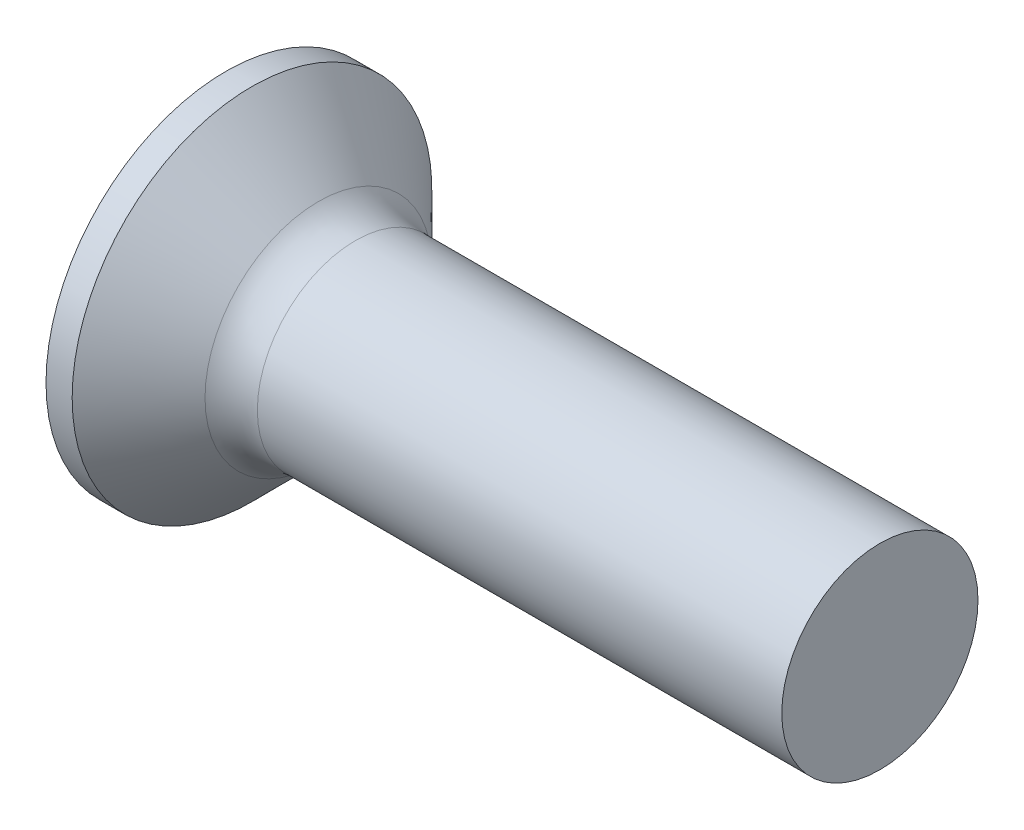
ISO-10303-21;
HEADER;
FILE_DESCRIPTION(('STEP AP214'),'2;1');
FILE_NAME('part.step','',(''),(''),'','','');
FILE_SCHEMA(('AUTOMOTIVE_DESIGN { 1 0 10303 214 1 1 1 1 }'));
ENDSEC;
DATA;
#1=APPLICATION_CONTEXT('core data for automotive mechanical design processes');
#2=APPLICATION_PROTOCOL_DEFINITION('international standard','automotive_design',2000,#1);
#3=PRODUCT_CONTEXT('',#1,'mechanical');
#4=PRODUCT('Part','Part','',(#3));
#5=PRODUCT_RELATED_PRODUCT_CATEGORY('part','',(#4));
#6=PRODUCT_DEFINITION_FORMATION('','',#4);
#7=PRODUCT_DEFINITION_CONTEXT('part definition',#1,'design');
#8=PRODUCT_DEFINITION('design','',#6,#7);
#9=PRODUCT_DEFINITION_SHAPE('','',#8);
#10=(LENGTH_UNIT() NAMED_UNIT(*) SI_UNIT(.MILLI.,.METRE.));
#11=(NAMED_UNIT(*) PLANE_ANGLE_UNIT() SI_UNIT($,.RADIAN.));
#12=(NAMED_UNIT(*) SI_UNIT($,.STERADIAN.) SOLID_ANGLE_UNIT());
#13=UNCERTAINTY_MEASURE_WITH_UNIT(LENGTH_MEASURE(1.E-05),#10,'distance_accuracy_value','');
#14=(GEOMETRIC_REPRESENTATION_CONTEXT(3) GLOBAL_UNCERTAINTY_ASSIGNED_CONTEXT((#13)) GLOBAL_UNIT_ASSIGNED_CONTEXT((#10,
#11,#12)) REPRESENTATION_CONTEXT('',''));
#15=CARTESIAN_POINT('',(0.,0.,0.));
#16=DIRECTION('',(0.,0.,1.));
#17=DIRECTION('',(1.,0.,0.));
#18=AXIS2_PLACEMENT_3D('',#15,#16,#17);
#19=CARTESIAN_POINT('',(0.,0.,0.));
#20=DIRECTION('',(-1.,0.,0.));
#21=DIRECTION('',(0.,0.,1.));
#22=AXIS2_PLACEMENT_3D('',#19,#20,#21);
#23=PLANE('',#22);
#24=CARTESIAN_POINT('',(0.,0.,0.));
#25=DIRECTION('',(-1.,0.,0.));
#26=DIRECTION('',(0.,0.,1.));
#27=AXIS2_PLACEMENT_3D('',#24,#25,#26);
#28=CIRCLE('',#27,2.75);
#29=CARTESIAN_POINT('',(0.,0.,2.75));
#30=VERTEX_POINT('',#29);
#31=EDGE_CURVE('E338',#30,#30,#28,.T.);
#32=ORIENTED_EDGE('',*,*,#31,.T.);
#33=EDGE_LOOP('',(#32));
#34=FACE_BOUND('',#33,.T.);
#35=DIRECTION('',(0.,0.,-1.));
#36=VECTOR('',#35,1.);
#37=CARTESIAN_POINT('',(0.,-0.370000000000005,1.5));
#38=LINE('',#37,#36);
#39=CARTESIAN_POINT('',(0.,-0.370000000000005,1.5));
#40=VERTEX_POINT('',#39);
#41=CARTESIAN_POINT('',(0.,-0.370000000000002,0.590157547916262));
#42=VERTEX_POINT('',#41);
#43=EDGE_CURVE('E377',#40,#42,#38,.T.);
#44=ORIENTED_EDGE('',*,*,#43,.T.);
#45=CARTESIAN_POINT('',(0.,0.,0.));
#46=DIRECTION('',(-1.,0.,0.));
#47=DIRECTION('',(0.,0.,1.));
#48=AXIS2_PLACEMENT_3D('',#45,#46,#47);
#49=CIRCLE('',#48,0.696552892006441);
#50=CARTESIAN_POINT('',(0.,-0.590157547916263,0.37));
#51=VERTEX_POINT('',#50);
#52=EDGE_CURVE('E364',#51,#42,#49,.T.);
#53=ORIENTED_EDGE('',*,*,#52,.F.);
#54=DIRECTION('',(0.,-1.,0.));
#55=VECTOR('',#54,1.);
#56=CARTESIAN_POINT('',(0.,1.5,0.37));
#57=LINE('',#56,#55);
#58=CARTESIAN_POINT('',(0.,-1.5,0.37));
#59=VERTEX_POINT('',#58);
#60=EDGE_CURVE('E424',#51,#59,#57,.T.);
#61=ORIENTED_EDGE('',*,*,#60,.T.);
#62=DIRECTION('',(0.,0.,-1.));
#63=VECTOR('',#62,1.);
#64=CARTESIAN_POINT('',(0.,-1.5,0.37));
#65=LINE('',#64,#63);
#66=CARTESIAN_POINT('',(0.,-1.5,-0.37));
#67=VERTEX_POINT('',#66);
#68=EDGE_CURVE('E335',#59,#67,#65,.T.);
#69=ORIENTED_EDGE('',*,*,#68,.T.);
#70=DIRECTION('',(0.,1.,0.));
#71=VECTOR('',#70,1.);
#72=CARTESIAN_POINT('',(0.,-1.5,-0.37));
#73=LINE('',#72,#71);
#74=CARTESIAN_POINT('',(0.,-0.590157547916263,-0.37));
#75=VERTEX_POINT('',#74);
#76=EDGE_CURVE('E425',#67,#75,#73,.T.);
#77=ORIENTED_EDGE('',*,*,#76,.T.);
#78=CARTESIAN_POINT('',(0.,-0.369999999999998,-0.590157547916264));
#79=VERTEX_POINT('',#78);
#80=EDGE_CURVE('E370',#79,#75,#49,.T.);
#81=ORIENTED_EDGE('',*,*,#80,.F.);
#82=CARTESIAN_POINT('',(0.,-0.369999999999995,-1.5));
#83=VERTEX_POINT('',#82);
#84=EDGE_CURVE('E386',#79,#83,#38,.T.);
#85=ORIENTED_EDGE('',*,*,#84,.T.);
#86=DIRECTION('',(0.,1.,0.));
#87=VECTOR('',#86,1.);
#88=CARTESIAN_POINT('',(0.,-0.369999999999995,-1.5));
#89=LINE('',#88,#87);
#90=CARTESIAN_POINT('',(0.,0.370000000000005,-1.5));
#91=VERTEX_POINT('',#90);
#92=EDGE_CURVE('E385',#83,#91,#89,.T.);
#93=ORIENTED_EDGE('',*,*,#92,.T.);
#94=DIRECTION('',(0.,0.,1.));
#95=VECTOR('',#94,1.);
#96=CARTESIAN_POINT('',(0.,0.370000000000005,-1.5));
#97=LINE('',#96,#95);
#98=CARTESIAN_POINT('',(0.,0.370000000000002,-0.590157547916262));
#99=VERTEX_POINT('',#98);
#100=EDGE_CURVE('E392',#91,#99,#97,.T.);
#101=ORIENTED_EDGE('',*,*,#100,.T.);
#102=CARTESIAN_POINT('',(0.,0.590157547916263,-0.37));
#103=VERTEX_POINT('',#102);
#104=EDGE_CURVE('E460',#103,#99,#49,.T.);
#105=ORIENTED_EDGE('',*,*,#104,.F.);
#106=CARTESIAN_POINT('',(0.,1.5,-0.37));
#107=VERTEX_POINT('',#106);
#108=EDGE_CURVE('E433',#103,#107,#73,.T.);
#109=ORIENTED_EDGE('',*,*,#108,.T.);
#110=DIRECTION('',(0.,0.,1.));
#111=VECTOR('',#110,1.);
#112=CARTESIAN_POINT('',(0.,1.5,-0.37));
#113=LINE('',#112,#111);
#114=CARTESIAN_POINT('',(0.,1.5,0.37));
#115=VERTEX_POINT('',#114);
#116=EDGE_CURVE('E421',#107,#115,#113,.T.);
#117=ORIENTED_EDGE('',*,*,#116,.T.);
#118=CARTESIAN_POINT('',(0.,0.590157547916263,0.37));
#119=VERTEX_POINT('',#118);
#120=EDGE_CURVE('E426',#115,#119,#57,.T.);
#121=ORIENTED_EDGE('',*,*,#120,.T.);
#122=CARTESIAN_POINT('',(0.,0.369999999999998,0.590157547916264));
#123=VERTEX_POINT('',#122);
#124=EDGE_CURVE('E372',#123,#119,#49,.T.);
#125=ORIENTED_EDGE('',*,*,#124,.F.);
#126=CARTESIAN_POINT('',(0.,0.369999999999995,1.5));
#127=VERTEX_POINT('',#126);
#128=EDGE_CURVE('E395',#123,#127,#97,.T.);
#129=ORIENTED_EDGE('',*,*,#128,.T.);
#130=DIRECTION('',(0.,-1.,0.));
#131=VECTOR('',#130,1.);
#132=CARTESIAN_POINT('',(0.,0.369999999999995,1.5));
#133=LINE('',#132,#131);
#134=EDGE_CURVE('E384',#127,#40,#133,.T.);
#135=ORIENTED_EDGE('',*,*,#134,.T.);
#136=EDGE_LOOP('',(#44,#53,#61,#69,#77,#81,#85,#93,#101,#105,#109,#117,#121,#125,#129,#135));
#137=FACE_BOUND('',#136,.T.);
#138=ADVANCED_FACE('F31',(#34,#137),#23,.T.);
#139=CARTESIAN_POINT('',(2.01,-0.49785100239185,0.37));
#140=DIRECTION('',(0.,0.,-1.));
#141=DIRECTION('',(0.,1.,0.));
#142=AXIS2_PLACEMENT_3D('',#139,#140,#141);
#143=PLANE('',#142);
#144=ORIENTED_EDGE('',*,*,#60,.F.);
#145=CARTESIAN_POINT('',(-1.01053649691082,-0.672102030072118,0.37));
#146=CARTESIAN_POINT('',(-0.79970605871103,-0.655267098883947,0.37));
#147=CARTESIAN_POINT('',(-0.588886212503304,-0.638297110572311,0.37));
#148=CARTESIAN_POINT('',(-0.167272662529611,-0.603984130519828,0.37));
#149=CARTESIAN_POINT('',(0.0435210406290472,-0.586641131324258,0.37));
#150=CARTESIAN_POINT('',(0.465068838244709,-0.551479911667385,0.37));
#151=CARTESIAN_POINT('',(0.67582293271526,-0.533661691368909,0.37));
#152=CARTESIAN_POINT('',(1.09727362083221,-0.497387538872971,0.37));
#153=CARTESIAN_POINT('',(1.30797021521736,-0.478931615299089,0.37));
#154=CARTESIAN_POINT('',(1.67418894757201,-0.446067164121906,0.37));
#155=CARTESIAN_POINT('',(1.82972932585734,-0.431862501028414,0.37));
#156=CARTESIAN_POINT('',(2.14074770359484,-0.40279770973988,0.37));
#157=CARTESIAN_POINT('',(2.29622570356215,-0.38793758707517,0.37));
#158=CARTESIAN_POINT('',(2.60710169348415,-0.357305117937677,0.37));
#159=CARTESIAN_POINT('',(2.76249967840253,-0.34153271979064,0.37));
#160=CARTESIAN_POINT('',(2.99549070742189,-0.316847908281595,0.37));
#161=CARTESIAN_POINT('',(3.07313791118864,-0.308448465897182,0.37));
#162=CARTESIAN_POINT('',(3.22838341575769,-0.29120225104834,0.37));
#163=CARTESIAN_POINT('',(3.30598171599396,-0.282355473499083,0.37));
#164=CARTESIAN_POINT('',(3.38354828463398,-0.273232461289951,0.37));
#165=B_SPLINE_CURVE_WITH_KNOTS('',3,(#145,#146,#147,#148,#149,#150,#151,#152,#153,#154,#155,
#156,#157,#158,#159,#160,#161,#162,#163,#164),.UNSPECIFIED.,.F.,.F.,(4,2,2,2,2,2,2,2,2,4),(0.,
0.634504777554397,1.26902224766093,1.90353950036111,2.53804817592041,3.00661008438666,
3.47516804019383,3.94375256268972,4.17805198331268,4.41235406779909),.UNSPECIFIED.);
#166=CARTESIAN_POINT('',(2.01,-0.415013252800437,0.37));
#167=VERTEX_POINT('',#166);
#168=EDGE_CURVE('E367',#51,#167,#165,.T.);
#169=ORIENTED_EDGE('',*,*,#168,.T.);
#170=DIRECTION('',(0.,-1.,0.));
#171=VECTOR('',#170,1.);
#172=CARTESIAN_POINT('',(2.01,0.497851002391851,0.37));
#173=LINE('',#172,#171);
#174=CARTESIAN_POINT('',(2.01,-0.497851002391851,0.37));
#175=VERTEX_POINT('',#174);
#176=EDGE_CURVE('E440',#167,#175,#173,.T.);
#177=ORIENTED_EDGE('',*,*,#176,.T.);
#178=DIRECTION('',(0.89493436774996,0.446197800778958,0.));
#179=VECTOR('',#178,1.);
#180=CARTESIAN_POINT('',(0.,-1.5,0.37));
#181=LINE('',#180,#179);
#182=EDGE_CURVE('E313',#59,#175,#181,.T.);
#183=ORIENTED_EDGE('',*,*,#182,.F.);
#184=EDGE_LOOP('',(#144,#169,#177,#183));
#185=FACE_BOUND('',#184,.T.);
#186=ADVANCED_FACE('F185',(#185),#143,.T.);
#187=CARTESIAN_POINT('',(2.01,0.497851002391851,0.37));
#188=VERTEX_POINT('',#187);
#189=CARTESIAN_POINT('',(2.01,0.415013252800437,0.37));
#190=VERTEX_POINT('',#189);
#191=EDGE_CURVE('E322',#188,#190,#173,.T.);
#192=ORIENTED_EDGE('',*,*,#191,.T.);
#193=CARTESIAN_POINT('',(-1.01053649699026,0.672102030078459,0.37));
#194=CARTESIAN_POINT('',(-0.799706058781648,0.65526709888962,0.37));
#195=CARTESIAN_POINT('',(-0.588886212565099,0.638297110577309,0.37));
#196=CARTESIAN_POINT('',(-0.167272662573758,0.603984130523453,0.37));
#197=CARTESIAN_POINT('',(0.043521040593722,0.586641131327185,0.37));
#198=CARTESIAN_POINT('',(0.465068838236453,0.551479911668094,0.37));
#199=CARTESIAN_POINT('',(0.675822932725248,0.533661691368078,0.37));
#200=CARTESIAN_POINT('',(1.09727362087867,0.497387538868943,0.37));
#201=CARTESIAN_POINT('',(1.30797021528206,0.478931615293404,0.37));
#202=CARTESIAN_POINT('',(1.67418894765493,0.446067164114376,0.37));
#203=CARTESIAN_POINT('',(1.82972932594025,0.431862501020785,0.37));
#204=CARTESIAN_POINT('',(2.14074770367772,0.402797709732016,0.37));
#205=CARTESIAN_POINT('',(2.29622570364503,0.38793758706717,0.37));
#206=CARTESIAN_POINT('',(2.60710169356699,0.357305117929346,0.37));
#207=CARTESIAN_POINT('',(2.76249967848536,0.341532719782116,0.37));
#208=CARTESIAN_POINT('',(2.99549070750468,0.316847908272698,0.37));
#209=CARTESIAN_POINT('',(3.07313791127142,0.308448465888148,0.37));
#210=CARTESIAN_POINT('',(3.22838341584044,0.291202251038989,0.37));
#211=CARTESIAN_POINT('',(3.30598171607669,0.282355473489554,0.37));
#212=CARTESIAN_POINT('',(3.38354828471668,0.273232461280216,0.37));
#213=B_SPLINE_CURVE_WITH_KNOTS('',3,(#193,#194,#195,#196,#197,#198,#199,#200,#201,#202,#203,
#204,#205,#206,#207,#208,#209,#210,#211,#212),.UNSPECIFIED.,.F.,.F.,(4,2,2,2,2,2,2,2,2,4),(0.,
0.634504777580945,1.26902224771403,1.90353950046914,2.53804817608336,3.00661008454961,
3.47516804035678,3.94375256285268,4.17805198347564,4.41235406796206),.UNSPECIFIED.);
#214=EDGE_CURVE('E245',#190,#119,#213,.F.);
#215=ORIENTED_EDGE('',*,*,#214,.T.);
#216=ORIENTED_EDGE('',*,*,#120,.F.);
#217=DIRECTION('',(0.89493436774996,-0.446197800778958,0.));
#218=VECTOR('',#217,1.);
#219=CARTESIAN_POINT('',(0.,1.5,0.37));
#220=LINE('',#219,#218);
#221=EDGE_CURVE('E54',#115,#188,#220,.T.);
#222=ORIENTED_EDGE('',*,*,#221,.T.);
#223=EDGE_LOOP('',(#192,#215,#216,#222));
#224=FACE_BOUND('',#223,.T.);
#225=ADVANCED_FACE('F190',(#224),#143,.T.);
#226=CARTESIAN_POINT('',(2.01,0.497851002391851,-0.37));
#227=DIRECTION('',(0.,0.,1.));
#228=DIRECTION('',(1.,0.,0.));
#229=AXIS2_PLACEMENT_3D('',#226,#227,#228);
#230=PLANE('',#229);
#231=DIRECTION('',(0.,1.,0.));
#232=VECTOR('',#231,1.);
#233=CARTESIAN_POINT('',(2.01,-0.497851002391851,-0.37));
#234=LINE('',#233,#232);
#235=CARTESIAN_POINT('',(2.01,-0.497851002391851,-0.37));
#236=VERTEX_POINT('',#235);
#237=CARTESIAN_POINT('',(2.01,-0.415013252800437,-0.37));
#238=VERTEX_POINT('',#237);
#239=EDGE_CURVE('E326',#236,#238,#234,.T.);
#240=ORIENTED_EDGE('',*,*,#239,.T.);
#241=CARTESIAN_POINT('',(-1.01053649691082,-0.672102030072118,-0.37));
#242=CARTESIAN_POINT('',(-0.79970605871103,-0.655267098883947,-0.37));
#243=CARTESIAN_POINT('',(-0.588886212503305,-0.638297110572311,-0.37));
#244=CARTESIAN_POINT('',(-0.16727266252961,-0.603984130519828,-0.37));
#245=CARTESIAN_POINT('',(0.0435210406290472,-0.586641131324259,-0.37));
#246=CARTESIAN_POINT('',(0.465068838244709,-0.551479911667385,-0.37));
#247=CARTESIAN_POINT('',(0.67582293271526,-0.533661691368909,-0.37));
#248=CARTESIAN_POINT('',(1.09727362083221,-0.497387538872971,-0.37));
#249=CARTESIAN_POINT('',(1.30797021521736,-0.47893161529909,-0.37));
#250=CARTESIAN_POINT('',(1.67418894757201,-0.446067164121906,-0.37));
#251=CARTESIAN_POINT('',(1.82972932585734,-0.431862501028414,-0.37));
#252=CARTESIAN_POINT('',(2.14074770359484,-0.40279770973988,-0.37));
#253=CARTESIAN_POINT('',(2.29622570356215,-0.38793758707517,-0.37));
#254=CARTESIAN_POINT('',(2.60710169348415,-0.357305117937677,-0.37));
#255=CARTESIAN_POINT('',(2.76249967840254,-0.34153271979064,-0.37));
#256=CARTESIAN_POINT('',(2.99549070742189,-0.316847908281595,-0.37));
#257=CARTESIAN_POINT('',(3.07313791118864,-0.308448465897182,-0.37));
#258=CARTESIAN_POINT('',(3.22838341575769,-0.29120225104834,-0.37));
#259=CARTESIAN_POINT('',(3.30598171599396,-0.282355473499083,-0.37));
#260=CARTESIAN_POINT('',(3.38354828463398,-0.273232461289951,-0.37));
#261=B_SPLINE_CURVE_WITH_KNOTS('',3,(#241,#242,#243,#244,#245,#246,#247,#248,#249,#250,#251,
#252,#253,#254,#255,#256,#257,#258,#259,#260),.UNSPECIFIED.,.F.,.F.,(4,2,2,2,2,2,2,2,2,4),(0.,
0.634504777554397,1.26902224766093,1.90353950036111,2.53804817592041,3.00661008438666,
3.47516804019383,3.94375256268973,4.17805198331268,4.41235406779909),.UNSPECIFIED.);
#262=EDGE_CURVE('E239',#238,#75,#261,.F.);
#263=ORIENTED_EDGE('',*,*,#262,.T.);
#264=ORIENTED_EDGE('',*,*,#76,.F.);
#265=DIRECTION('',(0.89493436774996,0.446197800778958,0.));
#266=VECTOR('',#265,1.);
#267=CARTESIAN_POINT('',(0.,-1.5,-0.37));
#268=LINE('',#267,#266);
#269=EDGE_CURVE('E435',#67,#236,#268,.T.);
#270=ORIENTED_EDGE('',*,*,#269,.T.);
#271=EDGE_LOOP('',(#240,#263,#264,#270));
#272=FACE_BOUND('',#271,.T.);
#273=ADVANCED_FACE('F225',(#272),#230,.T.);
#274=ORIENTED_EDGE('',*,*,#108,.F.);
#275=CARTESIAN_POINT('',(-1.01053649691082,0.672102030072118,-0.37));
#276=CARTESIAN_POINT('',(-0.79970605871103,0.655267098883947,-0.37));
#277=CARTESIAN_POINT('',(-0.588886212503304,0.638297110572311,-0.37));
#278=CARTESIAN_POINT('',(-0.16727266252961,0.603984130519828,-0.37));
#279=CARTESIAN_POINT('',(0.0435210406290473,0.586641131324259,-0.37));
#280=CARTESIAN_POINT('',(0.465068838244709,0.551479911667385,-0.37));
#281=CARTESIAN_POINT('',(0.67582293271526,0.533661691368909,-0.37));
#282=CARTESIAN_POINT('',(1.09727362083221,0.497387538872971,-0.37));
#283=CARTESIAN_POINT('',(1.30797021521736,0.478931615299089,-0.37));
#284=CARTESIAN_POINT('',(1.67418894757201,0.446067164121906,-0.37));
#285=CARTESIAN_POINT('',(1.82972932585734,0.431862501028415,-0.37));
#286=CARTESIAN_POINT('',(2.14074770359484,0.40279770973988,-0.37));
#287=CARTESIAN_POINT('',(2.29622570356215,0.38793758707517,-0.37));
#288=CARTESIAN_POINT('',(2.60710169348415,0.357305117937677,-0.37));
#289=CARTESIAN_POINT('',(2.76249967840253,0.34153271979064,-0.37));
#290=CARTESIAN_POINT('',(2.99549070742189,0.316847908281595,-0.37));
#291=CARTESIAN_POINT('',(3.07313791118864,0.308448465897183,-0.37));
#292=CARTESIAN_POINT('',(3.22838341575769,0.29120225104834,-0.37));
#293=CARTESIAN_POINT('',(3.30598171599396,0.282355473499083,-0.37));
#294=CARTESIAN_POINT('',(3.38354828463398,0.273232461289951,-0.37));
#295=B_SPLINE_CURVE_WITH_KNOTS('',3,(#275,#276,#277,#278,#279,#280,#281,#282,#283,#284,#285,
#286,#287,#288,#289,#290,#291,#292,#293,#294),.UNSPECIFIED.,.F.,.F.,(4,2,2,2,2,2,2,2,2,4),(0.,
0.634504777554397,1.26902224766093,1.90353950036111,2.53804817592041,3.00661008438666,
3.47516804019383,3.94375256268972,4.17805198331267,4.41235406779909),.UNSPECIFIED.);
#296=CARTESIAN_POINT('',(2.01,0.415013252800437,-0.37));
#297=VERTEX_POINT('',#296);
#298=EDGE_CURVE('E233',#103,#297,#295,.T.);
#299=ORIENTED_EDGE('',*,*,#298,.T.);
#300=CARTESIAN_POINT('',(2.01,0.497851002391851,-0.37));
#301=VERTEX_POINT('',#300);
#302=EDGE_CURVE('E330',#297,#301,#234,.T.);
#303=ORIENTED_EDGE('',*,*,#302,.T.);
#304=DIRECTION('',(0.89493436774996,-0.446197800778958,0.));
#305=VECTOR('',#304,1.);
#306=CARTESIAN_POINT('',(0.,1.5,-0.37));
#307=LINE('',#306,#305);
#308=EDGE_CURVE('E317',#107,#301,#307,.T.);
#309=ORIENTED_EDGE('',*,*,#308,.F.);
#310=EDGE_LOOP('',(#274,#299,#303,#309));
#311=FACE_BOUND('',#310,.T.);
#312=ADVANCED_FACE('F217',(#311),#230,.T.);
#313=CARTESIAN_POINT('',(2.01,0.497851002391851,-0.37));
#314=DIRECTION('',(1.,0.,0.));
#315=DIRECTION('',(0.,0.,-1.));
#316=AXIS2_PLACEMENT_3D('',#313,#314,#315);
#317=PLANE('',#316);
#318=CARTESIAN_POINT('',(2.01,0.,0.));
#319=DIRECTION('',(-1.,0.,0.));
#320=DIRECTION('',(0.,0.,1.));
#321=AXIS2_PLACEMENT_3D('',#318,#319,#320);
#322=CIRCLE('',#321,0.555999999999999);
#323=CARTESIAN_POINT('',(2.01,-0.247548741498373,-0.497851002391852));
#324=VERTEX_POINT('',#323);
#325=CARTESIAN_POINT('',(2.01,-0.369999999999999,-0.415013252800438));
#326=VERTEX_POINT('',#325);
#327=EDGE_CURVE('E507',#324,#326,#322,.T.);
#328=ORIENTED_EDGE('',*,*,#327,.F.);
#329=DIRECTION('',(0.,1.,0.));
#330=VECTOR('',#329,1.);
#331=CARTESIAN_POINT('',(2.01,-0.369999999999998,-0.497851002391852));
#332=LINE('',#331,#330);
#333=CARTESIAN_POINT('',(2.01,-0.369999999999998,-0.497851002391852));
#334=VERTEX_POINT('',#333);
#335=EDGE_CURVE('E407',#334,#324,#332,.T.);
#336=ORIENTED_EDGE('',*,*,#335,.F.);
#337=DIRECTION('',(0.,0.,-1.));
#338=VECTOR('',#337,1.);
#339=CARTESIAN_POINT('',(2.01,-0.370000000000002,0.497851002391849));
#340=LINE('',#339,#338);
#341=EDGE_CURVE('E411',#326,#334,#340,.T.);
#342=ORIENTED_EDGE('',*,*,#341,.F.);
#343=EDGE_LOOP('',(#328,#336,#342));
#344=FACE_BOUND('',#343,.T.);
#345=ADVANCED_FACE('F213',(#344),#317,.F.);
#346=CARTESIAN_POINT('',(2.01,-0.497851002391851,-0.247548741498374));
#347=VERTEX_POINT('',#346);
#348=EDGE_CURVE('E478',#238,#347,#322,.T.);
#349=ORIENTED_EDGE('',*,*,#348,.F.);
#350=ORIENTED_EDGE('',*,*,#239,.F.);
#351=DIRECTION('',(0.,0.,-1.));
#352=VECTOR('',#351,1.);
#353=CARTESIAN_POINT('',(2.01,-0.497851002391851,0.37));
#354=LINE('',#353,#352);
#355=EDGE_CURVE('E318',#347,#236,#354,.T.);
#356=ORIENTED_EDGE('',*,*,#355,.F.);
#357=EDGE_LOOP('',(#349,#350,#356));
#358=FACE_BOUND('',#357,.T.);
#359=ADVANCED_FACE('F216',(#358),#317,.F.);
#360=CARTESIAN_POINT('',(2.01,-0.497851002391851,0.247548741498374));
#361=VERTEX_POINT('',#360);
#362=EDGE_CURVE('E474',#361,#167,#322,.T.);
#363=ORIENTED_EDGE('',*,*,#362,.F.);
#364=EDGE_CURVE('E308',#175,#361,#354,.T.);
#365=ORIENTED_EDGE('',*,*,#364,.F.);
#366=ORIENTED_EDGE('',*,*,#176,.F.);
#367=EDGE_LOOP('',(#363,#365,#366));
#368=FACE_BOUND('',#367,.T.);
#369=ADVANCED_FACE('F472',(#368),#317,.F.);
#370=CARTESIAN_POINT('',(2.01,-0.370000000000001,0.415013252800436));
#371=VERTEX_POINT('',#370);
#372=CARTESIAN_POINT('',(2.01,-0.247548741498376,0.49785100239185));
#373=VERTEX_POINT('',#372);
#374=EDGE_CURVE('E46',#371,#373,#322,.T.);
#375=ORIENTED_EDGE('',*,*,#374,.F.);
#376=CARTESIAN_POINT('',(2.01,-0.370000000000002,0.497851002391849));
#377=VERTEX_POINT('',#376);
#378=EDGE_CURVE('E380',#377,#371,#340,.T.);
#379=ORIENTED_EDGE('',*,*,#378,.F.);
#380=DIRECTION('',(0.,-1.,0.));
#381=VECTOR('',#380,1.);
#382=CARTESIAN_POINT('',(2.01,0.369999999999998,0.497851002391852));
#383=LINE('',#382,#381);
#384=EDGE_CURVE('E412',#373,#377,#383,.T.);
#385=ORIENTED_EDGE('',*,*,#384,.F.);
#386=EDGE_LOOP('',(#375,#379,#385));
#387=FACE_BOUND('',#386,.T.);
#388=ADVANCED_FACE('F518',(#387),#317,.F.);
#389=CARTESIAN_POINT('',(2.01,0.247548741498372,0.497851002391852));
#390=VERTEX_POINT('',#389);
#391=CARTESIAN_POINT('',(2.01,0.369999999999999,0.415013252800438));
#392=VERTEX_POINT('',#391);
#393=EDGE_CURVE('E371',#390,#392,#322,.T.);
#394=ORIENTED_EDGE('',*,*,#393,.F.);
#395=CARTESIAN_POINT('',(2.01,0.369999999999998,0.497851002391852));
#396=VERTEX_POINT('',#395);
#397=EDGE_CURVE('E408',#396,#390,#383,.T.);
#398=ORIENTED_EDGE('',*,*,#397,.F.);
#399=DIRECTION('',(0.,0.,1.));
#400=VECTOR('',#399,1.);
#401=CARTESIAN_POINT('',(2.01,0.370000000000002,-0.49785100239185));
#402=LINE('',#401,#400);
#403=EDGE_CURVE('E420',#392,#396,#402,.T.);
#404=ORIENTED_EDGE('',*,*,#403,.F.);
#405=EDGE_LOOP('',(#394,#398,#404));
#406=FACE_BOUND('',#405,.T.);
#407=ADVANCED_FACE('F483',(#406),#317,.F.);
#408=CARTESIAN_POINT('',(2.01,0.497851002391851,0.247548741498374));
#409=VERTEX_POINT('',#408);
#410=EDGE_CURVE('E452',#190,#409,#322,.T.);
#411=ORIENTED_EDGE('',*,*,#410,.F.);
#412=ORIENTED_EDGE('',*,*,#191,.F.);
#413=DIRECTION('',(0.,0.,1.));
#414=VECTOR('',#413,1.);
#415=CARTESIAN_POINT('',(2.01,0.497851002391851,-0.37));
#416=LINE('',#415,#414);
#417=EDGE_CURVE('E329',#409,#188,#416,.T.);
#418=ORIENTED_EDGE('',*,*,#417,.F.);
#419=EDGE_LOOP('',(#411,#412,#418));
#420=FACE_BOUND('',#419,.T.);
#421=ADVANCED_FACE('F450',(#420),#317,.F.);
#422=CARTESIAN_POINT('',(2.01,0.497851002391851,-0.247548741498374));
#423=VERTEX_POINT('',#422);
#424=EDGE_CURVE('E458',#423,#297,#322,.T.);
#425=ORIENTED_EDGE('',*,*,#424,.F.);
#426=EDGE_CURVE('E438',#301,#423,#416,.T.);
#427=ORIENTED_EDGE('',*,*,#426,.F.);
#428=ORIENTED_EDGE('',*,*,#302,.F.);
#429=EDGE_LOOP('',(#425,#427,#428));
#430=FACE_BOUND('',#429,.T.);
#431=ADVANCED_FACE('F302',(#430),#317,.F.);
#432=CARTESIAN_POINT('',(2.01,0.370000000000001,-0.415013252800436));
#433=VERTEX_POINT('',#432);
#434=CARTESIAN_POINT('',(2.01,0.247548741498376,-0.49785100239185));
#435=VERTEX_POINT('',#434);
#436=EDGE_CURVE('E501',#433,#435,#322,.T.);
#437=ORIENTED_EDGE('',*,*,#436,.F.);
#438=CARTESIAN_POINT('',(2.01,0.370000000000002,-0.49785100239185));
#439=VERTEX_POINT('',#438);
#440=EDGE_CURVE('E417',#439,#433,#402,.T.);
#441=ORIENTED_EDGE('',*,*,#440,.F.);
#442=EDGE_CURVE('E414',#435,#439,#332,.T.);
#443=ORIENTED_EDGE('',*,*,#442,.F.);
#444=EDGE_LOOP('',(#437,#441,#443));
#445=FACE_BOUND('',#444,.T.);
#446=ADVANCED_FACE('F219',(#445),#317,.F.);
#447=CARTESIAN_POINT('',(2.01,-0.497851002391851,-0.37));
#448=DIRECTION('',(-0.446197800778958,0.89493436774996,0.));
#449=DIRECTION('',(-0.89493436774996,-0.446197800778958,0.));
#450=AXIS2_PLACEMENT_3D('',#447,#448,#449);
#451=PLANE('',#450);
#452=ORIENTED_EDGE('',*,*,#364,.T.);
#453=CARTESIAN_POINT('',(2.86902882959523,-0.0695550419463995,0.));
#454=DIRECTION('',(-0.446197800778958,0.89493436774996,0.));
#455=DIRECTION('',(-0.89493436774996,-0.446197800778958,0.));
#456=AXIS2_PLACEMENT_3D('',#453,#454,#455);
#457=ELLIPSE('',#456,1.11145965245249,0.491029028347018);
#458=EDGE_CURVE('E309',#361,#347,#457,.F.);
#459=ORIENTED_EDGE('',*,*,#458,.T.);
#460=ORIENTED_EDGE('',*,*,#355,.T.);
#461=ORIENTED_EDGE('',*,*,#269,.F.);
#462=ORIENTED_EDGE('',*,*,#68,.F.);
#463=ORIENTED_EDGE('',*,*,#182,.T.);
#464=EDGE_LOOP('',(#452,#459,#460,#461,#462,#463));
#465=FACE_BOUND('',#464,.T.);
#466=ADVANCED_FACE('F224',(#465),#451,.T.);
#467=CARTESIAN_POINT('',(2.01,0.497851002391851,0.37));
#468=DIRECTION('',(-0.446197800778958,-0.89493436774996,0.));
#469=DIRECTION('',(0.89493436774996,-0.446197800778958,0.));
#470=AXIS2_PLACEMENT_3D('',#467,#468,#469);
#471=PLANE('',#470);
#472=ORIENTED_EDGE('',*,*,#426,.T.);
#473=CARTESIAN_POINT('',(2.86902882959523,0.0695550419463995,0.));
#474=DIRECTION('',(-0.446197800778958,-0.89493436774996,0.));
#475=DIRECTION('',(-0.89493436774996,0.446197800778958,0.));
#476=AXIS2_PLACEMENT_3D('',#473,#474,#475);
#477=ELLIPSE('',#476,1.11145965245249,0.491029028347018);
#478=EDGE_CURVE('E286',#423,#409,#477,.F.);
#479=ORIENTED_EDGE('',*,*,#478,.T.);
#480=ORIENTED_EDGE('',*,*,#417,.T.);
#481=ORIENTED_EDGE('',*,*,#221,.F.);
#482=ORIENTED_EDGE('',*,*,#116,.F.);
#483=ORIENTED_EDGE('',*,*,#308,.T.);
#484=EDGE_LOOP('',(#472,#479,#480,#481,#482,#483));
#485=FACE_BOUND('',#484,.T.);
#486=ADVANCED_FACE('F220',(#485),#471,.T.);
#487=CARTESIAN_POINT('',(2.01,0.369999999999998,0.497851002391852));
#488=DIRECTION('',(0.,-1.,0.));
#489=DIRECTION('',(1.,0.,0.));
#490=AXIS2_PLACEMENT_3D('',#487,#488,#489);
#491=PLANE('',#490);
#492=ORIENTED_EDGE('',*,*,#440,.T.);
#493=CARTESIAN_POINT('',(-1.01053649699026,0.370000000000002,-0.672102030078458));
#494=CARTESIAN_POINT('',(-0.799706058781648,0.370000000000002,-0.655267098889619));
#495=CARTESIAN_POINT('',(-0.588886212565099,0.370000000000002,-0.638297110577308));
#496=CARTESIAN_POINT('',(-0.167272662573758,0.370000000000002,-0.603984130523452));
#497=CARTESIAN_POINT('',(0.0435210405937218,0.370000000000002,-0.586641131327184));
#498=CARTESIAN_POINT('',(0.465068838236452,0.370000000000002,-0.551479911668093));
#499=CARTESIAN_POINT('',(0.675822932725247,0.370000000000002,-0.533661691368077));
#500=CARTESIAN_POINT('',(1.09727362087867,0.370000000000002,-0.497387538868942));
#501=CARTESIAN_POINT('',(1.30797021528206,0.370000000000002,-0.478931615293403));
#502=CARTESIAN_POINT('',(1.67418894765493,0.370000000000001,-0.446067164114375));
#503=CARTESIAN_POINT('',(1.82972932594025,0.370000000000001,-0.431862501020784));
#504=CARTESIAN_POINT('',(2.14074770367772,0.370000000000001,-0.402797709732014));
#505=CARTESIAN_POINT('',(2.29622570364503,0.370000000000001,-0.387937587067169));
#506=CARTESIAN_POINT('',(2.60710169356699,0.370000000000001,-0.357305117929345));
#507=CARTESIAN_POINT('',(2.76249967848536,0.370000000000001,-0.341532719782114));
#508=CARTESIAN_POINT('',(2.99549070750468,0.370000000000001,-0.316847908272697));
#509=CARTESIAN_POINT('',(3.07313791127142,0.370000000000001,-0.308448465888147));
#510=CARTESIAN_POINT('',(3.22838341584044,0.370000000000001,-0.291202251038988));
#511=CARTESIAN_POINT('',(3.30598171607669,0.370000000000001,-0.282355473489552));
#512=CARTESIAN_POINT('',(3.38354828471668,0.370000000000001,-0.273232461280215));
#513=B_SPLINE_CURVE_WITH_KNOTS('',3,(#493,#494,#495,#496,#497,#498,#499,#500,#501,#502,#503,
#504,#505,#506,#507,#508,#509,#510,#511,#512),.UNSPECIFIED.,.F.,.F.,(4,2,2,2,2,2,2,2,2,4),(0.,
0.634504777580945,1.26902224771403,1.90353950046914,2.53804817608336,3.00661008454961,
3.47516804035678,3.94375256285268,4.17805198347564,4.41235406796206),.UNSPECIFIED.);
#514=EDGE_CURVE('E279',#433,#99,#513,.F.);
#515=ORIENTED_EDGE('',*,*,#514,.T.);
#516=ORIENTED_EDGE('',*,*,#100,.F.);
#517=DIRECTION('',(0.89493436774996,0.,0.446197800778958));
#518=VECTOR('',#517,1.);
#519=CARTESIAN_POINT('',(0.,0.370000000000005,-1.5));
#520=LINE('',#519,#518);
#521=EDGE_CURVE('E399',#91,#439,#520,.T.);
#522=ORIENTED_EDGE('',*,*,#521,.T.);
#523=EDGE_LOOP('',(#492,#515,#516,#522));
#524=FACE_BOUND('',#523,.T.);
#525=ADVANCED_FACE('F223',(#524),#491,.T.);
#526=CARTESIAN_POINT('',(2.01,-0.369999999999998,-0.497851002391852));
#527=DIRECTION('',(0.,1.,0.));
#528=DIRECTION('',(0.,0.,1.));
#529=AXIS2_PLACEMENT_3D('',#526,#527,#528);
#530=PLANE('',#529);
#531=ORIENTED_EDGE('',*,*,#84,.F.);
#532=CARTESIAN_POINT('',(-1.01053649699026,-0.369999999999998,-0.67210203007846));
#533=CARTESIAN_POINT('',(-0.799706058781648,-0.369999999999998,-0.655267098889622));
#534=CARTESIAN_POINT('',(-0.588886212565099,-0.369999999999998,-0.638297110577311));
#535=CARTESIAN_POINT('',(-0.167272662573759,-0.369999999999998,-0.603984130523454));
#536=CARTESIAN_POINT('',(0.0435210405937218,-0.369999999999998,-0.586641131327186));
#537=CARTESIAN_POINT('',(0.465068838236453,-0.369999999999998,-0.551479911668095));
#538=CARTESIAN_POINT('',(0.675822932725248,-0.369999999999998,-0.53366169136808));
#539=CARTESIAN_POINT('',(1.09727362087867,-0.369999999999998,-0.497387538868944));
#540=CARTESIAN_POINT('',(1.30797021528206,-0.369999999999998,-0.478931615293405));
#541=CARTESIAN_POINT('',(1.67418894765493,-0.369999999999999,-0.446067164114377));
#542=CARTESIAN_POINT('',(1.82972932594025,-0.369999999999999,-0.431862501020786));
#543=CARTESIAN_POINT('',(2.14074770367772,-0.369999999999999,-0.402797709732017));
#544=CARTESIAN_POINT('',(2.29622570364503,-0.369999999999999,-0.387937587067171));
#545=CARTESIAN_POINT('',(2.60710169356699,-0.369999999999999,-0.357305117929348));
#546=CARTESIAN_POINT('',(2.76249967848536,-0.369999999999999,-0.341532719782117));
#547=CARTESIAN_POINT('',(2.99549070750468,-0.369999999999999,-0.316847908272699));
#548=CARTESIAN_POINT('',(3.07313791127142,-0.369999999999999,-0.30844846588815));
#549=CARTESIAN_POINT('',(3.22838341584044,-0.369999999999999,-0.291202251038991));
#550=CARTESIAN_POINT('',(3.30598171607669,-0.369999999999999,-0.282355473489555));
#551=CARTESIAN_POINT('',(3.38354828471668,-0.369999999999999,-0.273232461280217));
#552=B_SPLINE_CURVE_WITH_KNOTS('',3,(#532,#533,#534,#535,#536,#537,#538,#539,#540,#541,#542,
#543,#544,#545,#546,#547,#548,#549,#550,#551),.UNSPECIFIED.,.F.,.F.,(4,2,2,2,2,2,2,2,2,4),(0.,
0.634504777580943,1.26902224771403,1.90353950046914,2.53804817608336,3.00661008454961,
3.47516804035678,3.94375256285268,4.17805198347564,4.41235406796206),.UNSPECIFIED.);
#553=EDGE_CURVE('E273',#79,#326,#552,.T.);
#554=ORIENTED_EDGE('',*,*,#553,.T.);
#555=ORIENTED_EDGE('',*,*,#341,.T.);
#556=DIRECTION('',(0.89493436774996,0.,0.446197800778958));
#557=VECTOR('',#556,1.);
#558=CARTESIAN_POINT('',(0.,-0.369999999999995,-1.5));
#559=LINE('',#558,#557);
#560=EDGE_CURVE('E396',#83,#334,#559,.T.);
#561=ORIENTED_EDGE('',*,*,#560,.F.);
#562=EDGE_LOOP('',(#531,#554,#555,#561));
#563=FACE_BOUND('',#562,.T.);
#564=ADVANCED_FACE('F290',(#563),#530,.T.);
#565=CARTESIAN_POINT('',(2.01,0.370000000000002,-0.49785100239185));
#566=DIRECTION('',(-0.446197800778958,0.,0.89493436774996));
#567=DIRECTION('',(-0.89493436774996,0.,-0.446197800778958));
#568=AXIS2_PLACEMENT_3D('',#565,#566,#567);
#569=PLANE('',#568);
#570=ORIENTED_EDGE('',*,*,#335,.T.);
#571=CARTESIAN_POINT('',(2.86902882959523,0.,-0.0695550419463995));
#572=DIRECTION('',(-0.446197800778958,0.,0.89493436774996));
#573=DIRECTION('',(-0.89493436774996,0.,-0.446197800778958));
#574=AXIS2_PLACEMENT_3D('',#571,#572,#573);
#575=ELLIPSE('',#574,1.11145965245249,0.491029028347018);
#576=EDGE_CURVE('E381',#324,#435,#575,.F.);
#577=ORIENTED_EDGE('',*,*,#576,.T.);
#578=ORIENTED_EDGE('',*,*,#442,.T.);
#579=ORIENTED_EDGE('',*,*,#521,.F.);
#580=ORIENTED_EDGE('',*,*,#92,.F.);
#581=ORIENTED_EDGE('',*,*,#560,.T.);
#582=EDGE_LOOP('',(#570,#577,#578,#579,#580,#581));
#583=FACE_BOUND('',#582,.T.);
#584=ADVANCED_FACE('F252',(#583),#569,.T.);
#585=ORIENTED_EDGE('',*,*,#378,.T.);
#586=CARTESIAN_POINT('',(-1.01053649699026,-0.370000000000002,0.672102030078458));
#587=CARTESIAN_POINT('',(-0.799706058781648,-0.370000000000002,0.655267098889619));
#588=CARTESIAN_POINT('',(-0.588886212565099,-0.370000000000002,0.638297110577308));
#589=CARTESIAN_POINT('',(-0.167272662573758,-0.370000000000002,0.603984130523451));
#590=CARTESIAN_POINT('',(0.0435210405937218,-0.370000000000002,0.586641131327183));
#591=CARTESIAN_POINT('',(0.465068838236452,-0.370000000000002,0.551479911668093));
#592=CARTESIAN_POINT('',(0.675822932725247,-0.370000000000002,0.533661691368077));
#593=CARTESIAN_POINT('',(1.09727362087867,-0.370000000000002,0.497387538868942));
#594=CARTESIAN_POINT('',(1.30797021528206,-0.370000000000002,0.478931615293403));
#595=CARTESIAN_POINT('',(1.67418894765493,-0.370000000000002,0.446067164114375));
#596=CARTESIAN_POINT('',(1.82972932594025,-0.370000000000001,0.431862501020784));
#597=CARTESIAN_POINT('',(2.14074770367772,-0.370000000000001,0.402797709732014));
#598=CARTESIAN_POINT('',(2.29622570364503,-0.370000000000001,0.387937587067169));
#599=CARTESIAN_POINT('',(2.60710169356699,-0.370000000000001,0.357305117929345));
#600=CARTESIAN_POINT('',(2.76249967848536,-0.370000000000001,0.341532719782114));
#601=CARTESIAN_POINT('',(2.99549070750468,-0.370000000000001,0.316847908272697));
#602=CARTESIAN_POINT('',(3.07313791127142,-0.370000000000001,0.308448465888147));
#603=CARTESIAN_POINT('',(3.22838341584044,-0.370000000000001,0.291202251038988));
#604=CARTESIAN_POINT('',(3.30598171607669,-0.370000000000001,0.282355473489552));
#605=CARTESIAN_POINT('',(3.38354828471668,-0.370000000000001,0.273232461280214));
#606=B_SPLINE_CURVE_WITH_KNOTS('',3,(#586,#587,#588,#589,#590,#591,#592,#593,#594,#595,#596,
#597,#598,#599,#600,#601,#602,#603,#604,#605),.UNSPECIFIED.,.F.,.F.,(4,2,2,2,2,2,2,2,2,4),(0.,
0.634504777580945,1.26902224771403,1.90353950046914,2.53804817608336,3.00661008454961,
3.47516804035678,3.94375256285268,4.17805198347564,4.41235406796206),.UNSPECIFIED.);
#607=EDGE_CURVE('E266',#371,#42,#606,.F.);
#608=ORIENTED_EDGE('',*,*,#607,.T.);
#609=ORIENTED_EDGE('',*,*,#43,.F.);
#610=DIRECTION('',(0.89493436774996,0.,-0.446197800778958));
#611=VECTOR('',#610,1.);
#612=CARTESIAN_POINT('',(0.,-0.370000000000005,1.5));
#613=LINE('',#612,#611);
#614=EDGE_CURVE('E402',#40,#377,#613,.T.);
#615=ORIENTED_EDGE('',*,*,#614,.T.);
#616=EDGE_LOOP('',(#585,#608,#609,#615));
#617=FACE_BOUND('',#616,.T.);
#618=ADVANCED_FACE('F375',(#617),#530,.T.);
#619=ORIENTED_EDGE('',*,*,#128,.F.);
#620=CARTESIAN_POINT('',(-1.01053649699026,0.369999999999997,0.67210203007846));
#621=CARTESIAN_POINT('',(-0.799706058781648,0.369999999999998,0.655267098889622));
#622=CARTESIAN_POINT('',(-0.588886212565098,0.369999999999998,0.638297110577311));
#623=CARTESIAN_POINT('',(-0.167272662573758,0.369999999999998,0.603984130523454));
#624=CARTESIAN_POINT('',(0.0435210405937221,0.369999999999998,0.586641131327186));
#625=CARTESIAN_POINT('',(0.465068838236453,0.369999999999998,0.551479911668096));
#626=CARTESIAN_POINT('',(0.675822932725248,0.369999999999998,0.53366169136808));
#627=CARTESIAN_POINT('',(1.09727362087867,0.369999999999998,0.497387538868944));
#628=CARTESIAN_POINT('',(1.30797021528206,0.369999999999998,0.478931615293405));
#629=CARTESIAN_POINT('',(1.67418894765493,0.369999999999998,0.446067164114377));
#630=CARTESIAN_POINT('',(1.82972932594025,0.369999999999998,0.431862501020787));
#631=CARTESIAN_POINT('',(2.14074770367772,0.369999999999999,0.402797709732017));
#632=CARTESIAN_POINT('',(2.29622570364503,0.369999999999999,0.387937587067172));
#633=CARTESIAN_POINT('',(2.60710169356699,0.369999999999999,0.357305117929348));
#634=CARTESIAN_POINT('',(2.76249967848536,0.369999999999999,0.341532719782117));
#635=CARTESIAN_POINT('',(2.99549070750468,0.369999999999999,0.3168479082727));
#636=CARTESIAN_POINT('',(3.07313791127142,0.369999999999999,0.30844846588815));
#637=CARTESIAN_POINT('',(3.22838341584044,0.369999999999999,0.291202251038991));
#638=CARTESIAN_POINT('',(3.30598171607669,0.369999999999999,0.282355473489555));
#639=CARTESIAN_POINT('',(3.38354828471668,0.369999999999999,0.273232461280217));
#640=B_SPLINE_CURVE_WITH_KNOTS('',3,(#620,#621,#622,#623,#624,#625,#626,#627,#628,#629,#630,
#631,#632,#633,#634,#635,#636,#637,#638,#639),.UNSPECIFIED.,.F.,.F.,(4,2,2,2,2,2,2,2,2,4),(0.,
0.634504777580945,1.26902224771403,1.90353950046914,2.53804817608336,3.00661008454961,
3.47516804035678,3.94375256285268,4.17805198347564,4.41235406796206),.UNSPECIFIED.);
#641=EDGE_CURVE('E257',#123,#392,#640,.T.);
#642=ORIENTED_EDGE('',*,*,#641,.T.);
#643=ORIENTED_EDGE('',*,*,#403,.T.);
#644=DIRECTION('',(0.89493436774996,0.,-0.446197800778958));
#645=VECTOR('',#644,1.);
#646=CARTESIAN_POINT('',(0.,0.369999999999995,1.5));
#647=LINE('',#646,#645);
#648=EDGE_CURVE('E404',#127,#396,#647,.T.);
#649=ORIENTED_EDGE('',*,*,#648,.F.);
#650=EDGE_LOOP('',(#619,#642,#643,#649));
#651=FACE_BOUND('',#650,.T.);
#652=ADVANCED_FACE('F292',(#651),#491,.T.);
#653=CARTESIAN_POINT('',(2.01,-0.370000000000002,0.497851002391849));
#654=DIRECTION('',(-0.446197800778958,0.,-0.89493436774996));
#655=DIRECTION('',(0.89493436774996,0.,-0.446197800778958));
#656=AXIS2_PLACEMENT_3D('',#653,#654,#655);
#657=PLANE('',#656);
#658=ORIENTED_EDGE('',*,*,#397,.T.);
#659=CARTESIAN_POINT('',(2.86902882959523,0.,0.0695550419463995));
#660=DIRECTION('',(-0.446197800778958,0.,-0.89493436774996));
#661=DIRECTION('',(-0.89493436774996,0.,0.446197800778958));
#662=AXIS2_PLACEMENT_3D('',#659,#660,#661);
#663=ELLIPSE('',#662,1.11145965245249,0.491029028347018);
#664=EDGE_CURVE('E11',#390,#373,#663,.F.);
#665=ORIENTED_EDGE('',*,*,#664,.T.);
#666=ORIENTED_EDGE('',*,*,#384,.T.);
#667=ORIENTED_EDGE('',*,*,#614,.F.);
#668=ORIENTED_EDGE('',*,*,#134,.F.);
#669=ORIENTED_EDGE('',*,*,#648,.T.);
#670=EDGE_LOOP('',(#658,#665,#666,#667,#668,#669));
#671=FACE_BOUND('',#670,.T.);
#672=ADVANCED_FACE('F200',(#671),#657,.T.);
#673=CARTESIAN_POINT('',(-6.34999999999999,0.,0.));
#674=DIRECTION('',(-1.,0.,0.));
#675=DIRECTION('',(0.,0.,1.));
#676=AXIS2_PLACEMENT_3D('',#673,#674,#675);
#677=CYLINDRICAL_SURFACE('',#676,2.75);
#678=CARTESIAN_POINT('',(0.400000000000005,0.,0.));
#679=DIRECTION('',(-1.,0.,0.));
#680=DIRECTION('',(0.,0.,1.));
#681=AXIS2_PLACEMENT_3D('',#678,#679,#680);
#682=CIRCLE('',#681,2.75);
#683=CARTESIAN_POINT('',(0.400000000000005,0.,2.75));
#684=VERTEX_POINT('',#683);
#685=EDGE_CURVE('E334',#684,#684,#682,.T.);
#686=ORIENTED_EDGE('',*,*,#685,.T.);
#687=EDGE_LOOP('',(#686));
#688=FACE_BOUND('',#687,.T.);
#689=ORIENTED_EDGE('',*,*,#31,.F.);
#690=EDGE_LOOP('',(#689));
#691=FACE_BOUND('',#690,.T.);
#692=ADVANCED_FACE('F196',(#688,#691),#677,.T.);
#693=CARTESIAN_POINT('',(0.400000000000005,0.,0.));
#694=DIRECTION('',(-1.,0.,0.));
#695=DIRECTION('',(0.,0.,1.));
#696=AXIS2_PLACEMENT_3D('',#693,#694,#695);
#697=CONICAL_SURFACE('',#696,2.75,0.78539816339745);
#698=CARTESIAN_POINT('',(1.41568542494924,0.,0.));
#699=DIRECTION('',(-1.,0.,0.));
#700=DIRECTION('',(0.,0.,1.));
#701=AXIS2_PLACEMENT_3D('',#698,#699,#700);
#702=CIRCLE('',#701,1.73431457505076);
#703=CARTESIAN_POINT('',(1.41568542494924,0.,1.73431457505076));
#704=VERTEX_POINT('',#703);
#705=EDGE_CURVE('E340',#704,#704,#702,.T.);
#706=ORIENTED_EDGE('',*,*,#705,.T.);
#707=EDGE_LOOP('',(#706));
#708=FACE_BOUND('',#707,.T.);
#709=ORIENTED_EDGE('',*,*,#685,.F.);
#710=EDGE_LOOP('',(#709));
#711=FACE_BOUND('',#710,.T.);
#712=ADVANCED_FACE('F199',(#708,#711),#697,.T.);
#713=CARTESIAN_POINT('',(-6.34999999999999,0.,0.));
#714=DIRECTION('',(-1.,0.,0.));
#715=DIRECTION('',(0.,0.,1.));
#716=AXIS2_PLACEMENT_3D('',#713,#714,#715);
#717=CYLINDRICAL_SURFACE('',#716,1.5);
#718=CARTESIAN_POINT('',(1.98137084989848,0.,0.));
#719=DIRECTION('',(-1.,0.,0.));
#720=DIRECTION('',(0.,0.,1.));
#721=AXIS2_PLACEMENT_3D('',#718,#719,#720);
#722=CIRCLE('',#721,1.5);
#723=CARTESIAN_POINT('',(1.98137084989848,0.,1.5));
#724=VERTEX_POINT('',#723);
#725=EDGE_CURVE('E39',#724,#724,#722,.F.);
#726=ORIENTED_EDGE('',*,*,#725,.T.);
#727=EDGE_LOOP('',(#726));
#728=FACE_BOUND('',#727,.T.);
#729=CARTESIAN_POINT('',(10.,0.,0.));
#730=DIRECTION('',(-1.,0.,0.));
#731=DIRECTION('',(0.,0.,1.));
#732=AXIS2_PLACEMENT_3D('',#729,#730,#731);
#733=CIRCLE('',#732,1.5);
#734=CARTESIAN_POINT('',(10.,0.,1.5));
#735=VERTEX_POINT('',#734);
#736=EDGE_CURVE('E331',#735,#735,#733,.T.);
#737=ORIENTED_EDGE('',*,*,#736,.T.);
#738=EDGE_LOOP('',(#737));
#739=FACE_BOUND('',#738,.T.);
#740=ADVANCED_FACE('F204',(#728,#739),#717,.T.);
#741=CARTESIAN_POINT('',(10.,1.5,0.));
#742=DIRECTION('',(1.,0.,0.));
#743=DIRECTION('',(0.,0.,-1.));
#744=AXIS2_PLACEMENT_3D('',#741,#742,#743);
#745=PLANE('',#744);
#746=ORIENTED_EDGE('',*,*,#736,.F.);
#747=EDGE_LOOP('',(#746));
#748=FACE_BOUND('',#747,.T.);
#749=ADVANCED_FACE('F208',(#748),#745,.T.);
#750=CARTESIAN_POINT('',(1.98137084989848,0.,0.));
#751=DIRECTION('',(-1.,0.,0.));
#752=DIRECTION('',(0.,0.,1.));
#753=AXIS2_PLACEMENT_3D('',#750,#751,#752);
#754=TOROIDAL_SURFACE('',#753,2.3,0.8);
#755=ORIENTED_EDGE('',*,*,#725,.F.);
#756=EDGE_LOOP('',(#755));
#757=FACE_BOUND('',#756,.T.);
#758=ORIENTED_EDGE('',*,*,#705,.F.);
#759=EDGE_LOOP('',(#758));
#760=FACE_BOUND('',#759,.T.);
#761=ADVANCED_FACE('F33',(#757,#760),#754,.F.);
#762=CARTESIAN_POINT('',(2.01,0.,0.));
#763=DIRECTION('',(-1.,0.,0.));
#764=DIRECTION('',(0.,0.,1.));
#765=AXIS2_PLACEMENT_3D('',#762,#763,#764);
#766=CONICAL_SURFACE('',#765,0.555999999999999,0.0698131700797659);
#767=ORIENTED_EDGE('',*,*,#52,.T.);
#768=ORIENTED_EDGE('',*,*,#607,.F.);
#769=EDGE_CURVE('E477',#167,#371,#322,.T.);
#770=ORIENTED_EDGE('',*,*,#769,.F.);
#771=ORIENTED_EDGE('',*,*,#168,.F.);
#772=EDGE_LOOP('',(#767,#768,#770,#771));
#773=FACE_BOUND('',#772,.T.);
#774=ADVANCED_FACE('F182',(#773),#766,.F.);
#775=EDGE_CURVE('E455',#392,#190,#322,.T.);
#776=ORIENTED_EDGE('',*,*,#775,.F.);
#777=ORIENTED_EDGE('',*,*,#641,.F.);
#778=ORIENTED_EDGE('',*,*,#124,.T.);
#779=ORIENTED_EDGE('',*,*,#214,.F.);
#780=EDGE_LOOP('',(#776,#777,#778,#779));
#781=FACE_BOUND('',#780,.T.);
#782=ADVANCED_FACE('F356',(#781),#766,.F.);
#783=EDGE_CURVE('E510',#326,#238,#322,.T.);
#784=ORIENTED_EDGE('',*,*,#783,.F.);
#785=ORIENTED_EDGE('',*,*,#553,.F.);
#786=ORIENTED_EDGE('',*,*,#80,.T.);
#787=ORIENTED_EDGE('',*,*,#262,.F.);
#788=EDGE_LOOP('',(#784,#785,#786,#787));
#789=FACE_BOUND('',#788,.T.);
#790=ADVANCED_FACE('F361',(#789),#766,.F.);
#791=ORIENTED_EDGE('',*,*,#104,.T.);
#792=ORIENTED_EDGE('',*,*,#514,.F.);
#793=EDGE_CURVE('E500',#297,#433,#322,.T.);
#794=ORIENTED_EDGE('',*,*,#793,.F.);
#795=ORIENTED_EDGE('',*,*,#298,.F.);
#796=EDGE_LOOP('',(#791,#792,#794,#795));
#797=FACE_BOUND('',#796,.T.);
#798=ADVANCED_FACE('F613',(#797),#766,.F.);
#799=EDGE_CURVE('E456',#409,#423,#322,.T.);
#800=ORIENTED_EDGE('',*,*,#799,.F.);
#801=ORIENTED_EDGE('',*,*,#478,.F.);
#802=EDGE_LOOP('',(#800,#801));
#803=FACE_BOUND('',#802,.T.);
#804=ADVANCED_FACE('F621',(#803),#766,.F.);
#805=EDGE_CURVE('E476',#347,#361,#322,.T.);
#806=ORIENTED_EDGE('',*,*,#805,.F.);
#807=ORIENTED_EDGE('',*,*,#458,.F.);
#808=EDGE_LOOP('',(#806,#807));
#809=FACE_BOUND('',#808,.T.);
#810=ADVANCED_FACE('F629',(#809),#766,.F.);
#811=EDGE_CURVE('E504',#435,#324,#322,.T.);
#812=ORIENTED_EDGE('',*,*,#811,.F.);
#813=ORIENTED_EDGE('',*,*,#576,.F.);
#814=EDGE_LOOP('',(#812,#813));
#815=FACE_BOUND('',#814,.T.);
#816=ADVANCED_FACE('F179',(#815),#766,.F.);
#817=EDGE_CURVE('E459',#373,#390,#322,.T.);
#818=ORIENTED_EDGE('',*,*,#817,.F.);
#819=ORIENTED_EDGE('',*,*,#664,.F.);
#820=EDGE_LOOP('',(#818,#819));
#821=FACE_BOUND('',#820,.T.);
#822=ADVANCED_FACE('F174',(#821),#766,.F.);
#823=CARTESIAN_POINT('',(2.19065535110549,0.,0.));
#824=DIRECTION('',(-1.,0.,0.));
#825=DIRECTION('',(0.,0.,1.));
#826=AXIS2_PLACEMENT_3D('',#823,#824,#825);
#827=CONICAL_SURFACE('',#826,0.,1.25663706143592);
#828=ORIENTED_EDGE('',*,*,#393,.T.);
#829=ORIENTED_EDGE('',*,*,#775,.T.);
#830=ORIENTED_EDGE('',*,*,#410,.T.);
#831=ORIENTED_EDGE('',*,*,#799,.T.);
#832=ORIENTED_EDGE('',*,*,#424,.T.);
#833=ORIENTED_EDGE('',*,*,#793,.T.);
#834=ORIENTED_EDGE('',*,*,#436,.T.);
#835=ORIENTED_EDGE('',*,*,#811,.T.);
#836=ORIENTED_EDGE('',*,*,#327,.T.);
#837=ORIENTED_EDGE('',*,*,#783,.T.);
#838=ORIENTED_EDGE('',*,*,#348,.T.);
#839=ORIENTED_EDGE('',*,*,#805,.T.);
#840=ORIENTED_EDGE('',*,*,#362,.T.);
#841=ORIENTED_EDGE('',*,*,#769,.T.);
#842=ORIENTED_EDGE('',*,*,#374,.T.);
#843=ORIENTED_EDGE('',*,*,#817,.T.);
#844=EDGE_LOOP('',(#828,#829,#830,#831,#832,#833,#834,#835,#836,#837,#838,#839,#840,#841,#842,#843));
#845=FACE_BOUND('',#844,.T.);
#846=CARTESIAN_POINT('',(2.19065535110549,0.,0.));
#847=VERTEX_POINT('',#846);
#848=VERTEX_LOOP('',#847);
#849=FACE_BOUND('',#848,.T.);
#850=ADVANCED_FACE('F172',(#845,#849),#827,.F.);
#851=CLOSED_SHELL('',(#138,#186,#225,#273,#312,#345,#359,#369,#388,#407,#421,#431,#446,#466,
#486,#525,#564,#584,#618,#652,#672,#692,#712,#740,#749,#761,#774,#782,#790,#798,#804,#810,#816,
#822,#850));
#852=MANIFOLD_SOLID_BREP('B2',#851);
#853=ADVANCED_BREP_SHAPE_REPRESENTATION('',(#18,#852),#14);
#854=SHAPE_DEFINITION_REPRESENTATION(#9,#853);
ENDSEC;
END-ISO-10303-21;
